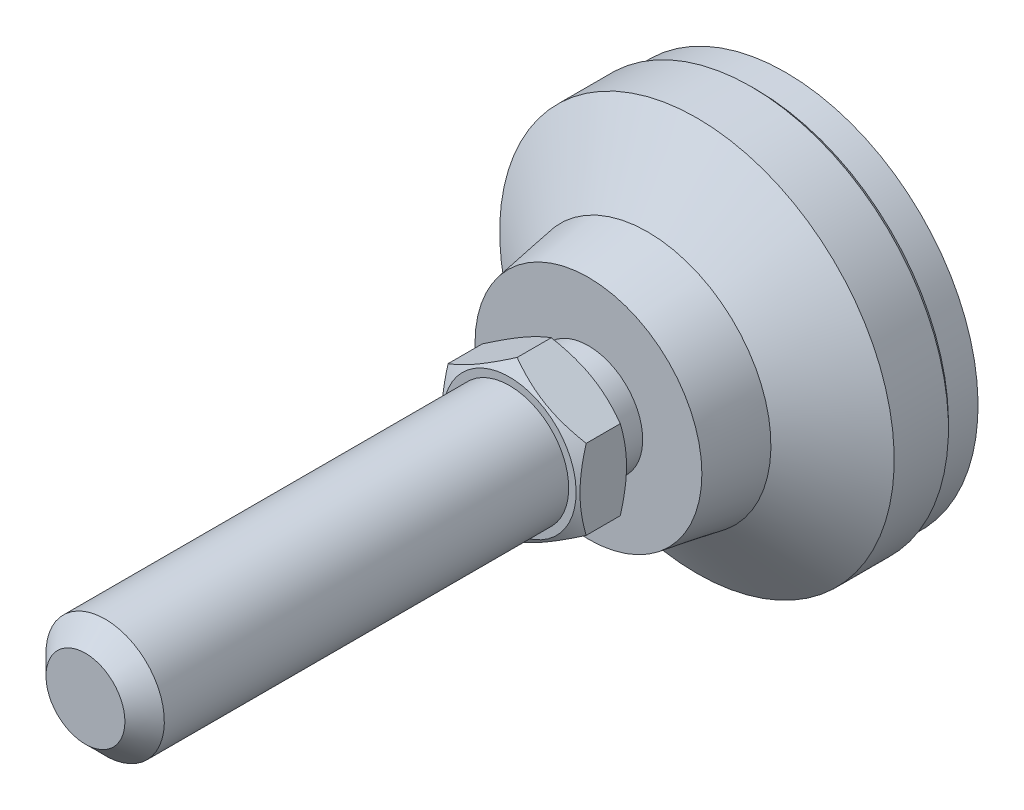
ISO-10303-21;
HEADER;
FILE_DESCRIPTION(('STEP AP214'),'2;1');
FILE_NAME('part.step','',(''),(''),'','','');
FILE_SCHEMA(('AUTOMOTIVE_DESIGN { 1 0 10303 214 1 1 1 1 }'));
ENDSEC;
DATA;
#1=APPLICATION_CONTEXT('core data for automotive mechanical design processes');
#2=APPLICATION_PROTOCOL_DEFINITION('international standard','automotive_design',2000,#1);
#3=PRODUCT_CONTEXT('',#1,'mechanical');
#4=PRODUCT('Part','Part','',(#3));
#5=PRODUCT_RELATED_PRODUCT_CATEGORY('part','',(#4));
#6=PRODUCT_DEFINITION_FORMATION('','',#4);
#7=PRODUCT_DEFINITION_CONTEXT('part definition',#1,'design');
#8=PRODUCT_DEFINITION('design','',#6,#7);
#9=PRODUCT_DEFINITION_SHAPE('','',#8);
#10=(LENGTH_UNIT() NAMED_UNIT(*) SI_UNIT(.MILLI.,.METRE.));
#11=(NAMED_UNIT(*) PLANE_ANGLE_UNIT() SI_UNIT($,.RADIAN.));
#12=(NAMED_UNIT(*) SI_UNIT($,.STERADIAN.) SOLID_ANGLE_UNIT());
#13=UNCERTAINTY_MEASURE_WITH_UNIT(LENGTH_MEASURE(1.E-05),#10,'distance_accuracy_value','');
#14=(GEOMETRIC_REPRESENTATION_CONTEXT(3) GLOBAL_UNCERTAINTY_ASSIGNED_CONTEXT((#13)) GLOBAL_UNIT_ASSIGNED_CONTEXT((#10,
#11,#12)) REPRESENTATION_CONTEXT('',''));
#15=CARTESIAN_POINT('',(0.,0.,0.));
#16=DIRECTION('',(0.,0.,1.));
#17=DIRECTION('',(1.,0.,0.));
#18=AXIS2_PLACEMENT_3D('',#15,#16,#17);
#19=CARTESIAN_POINT('',(0.,0.,1.99999999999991));
#20=DIRECTION('',(0.,0.,-1.));
#21=DIRECTION('',(0.,1.,0.));
#22=AXIS2_PLACEMENT_3D('',#19,#20,#21);
#23=CYLINDRICAL_SURFACE('',#22,20.);
#24=CARTESIAN_POINT('',(0.,0.,3.5));
#25=DIRECTION('',(0.,0.,-1.));
#26=DIRECTION('',(0.,1.,0.));
#27=AXIS2_PLACEMENT_3D('',#24,#25,#26);
#28=CIRCLE('',#27,20.);
#29=CARTESIAN_POINT('',(0.,20.,3.5));
#30=VERTEX_POINT('',#29);
#31=EDGE_CURVE('E114',#30,#30,#28,.F.);
#32=ORIENTED_EDGE('',*,*,#31,.T.);
#33=EDGE_LOOP('',(#32));
#34=FACE_BOUND('',#33,.T.);
#35=CARTESIAN_POINT('',(0.,0.,9.));
#36=DIRECTION('',(0.,0.,-1.));
#37=DIRECTION('',(0.,1.,0.));
#38=AXIS2_PLACEMENT_3D('',#35,#36,#37);
#39=CIRCLE('',#38,20.);
#40=CARTESIAN_POINT('',(0.,20.,9.));
#41=VERTEX_POINT('',#40);
#42=EDGE_CURVE('E108',#41,#41,#39,.T.);
#43=ORIENTED_EDGE('',*,*,#42,.T.);
#44=EDGE_LOOP('',(#43));
#45=FACE_BOUND('',#44,.T.);
#46=ADVANCED_FACE('F14',(#34,#45),#23,.T.);
#47=CARTESIAN_POINT('',(0.,0.,14.));
#48=DIRECTION('',(0.,0.,-1.));
#49=DIRECTION('',(0.,1.,0.));
#50=AXIS2_PLACEMENT_3D('',#47,#48,#49);
#51=CONICAL_SURFACE('',#50,12.5,0.98279372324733);
#52=ORIENTED_EDGE('',*,*,#42,.F.);
#53=EDGE_LOOP('',(#52));
#54=FACE_BOUND('',#53,.T.);
#55=CARTESIAN_POINT('',(0.,0.,14.));
#56=DIRECTION('',(0.,0.,-1.));
#57=DIRECTION('',(0.,1.,0.));
#58=AXIS2_PLACEMENT_3D('',#55,#56,#57);
#59=CIRCLE('',#58,12.5);
#60=CARTESIAN_POINT('',(0.,12.5,14.));
#61=VERTEX_POINT('',#60);
#62=EDGE_CURVE('E105',#61,#61,#59,.T.);
#63=ORIENTED_EDGE('',*,*,#62,.T.);
#64=EDGE_LOOP('',(#63));
#65=FACE_BOUND('',#64,.T.);
#66=ADVANCED_FACE('F226',(#54,#65),#51,.T.);
#67=CARTESIAN_POINT('',(0.,0.,20.));
#68=DIRECTION('',(0.,0.,-1.));
#69=DIRECTION('',(0.,1.,0.));
#70=AXIS2_PLACEMENT_3D('',#67,#68,#69);
#71=CONICAL_SURFACE('',#70,11.5,0.165148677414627);
#72=ORIENTED_EDGE('',*,*,#62,.F.);
#73=EDGE_LOOP('',(#72));
#74=FACE_BOUND('',#73,.T.);
#75=CARTESIAN_POINT('',(0.,0.,20.));
#76=DIRECTION('',(0.,0.,-1.));
#77=DIRECTION('',(0.,1.,0.));
#78=AXIS2_PLACEMENT_3D('',#75,#76,#77);
#79=CIRCLE('',#78,11.5);
#80=CARTESIAN_POINT('',(0.,11.5,20.));
#81=VERTEX_POINT('',#80);
#82=EDGE_CURVE('E102',#81,#81,#79,.T.);
#83=ORIENTED_EDGE('',*,*,#82,.T.);
#84=EDGE_LOOP('',(#83));
#85=FACE_BOUND('',#84,.T.);
#86=ADVANCED_FACE('F222',(#74,#85),#71,.T.);
#87=CARTESIAN_POINT('',(-11.5,0.,20.));
#88=DIRECTION('',(0.,0.,-1.));
#89=DIRECTION('',(0.,1.,0.));
#90=AXIS2_PLACEMENT_3D('',#87,#88,#89);
#91=PLANE('',#90);
#92=ORIENTED_EDGE('',*,*,#82,.F.);
#93=EDGE_LOOP('',(#92));
#94=FACE_BOUND('',#93,.T.);
#95=CARTESIAN_POINT('',(0.,0.,20.));
#96=DIRECTION('',(0.,0.,-1.));
#97=DIRECTION('',(0.,1.,0.));
#98=AXIS2_PLACEMENT_3D('',#95,#96,#97);
#99=CIRCLE('',#98,5.49999999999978);
#100=CARTESIAN_POINT('',(0.,5.49999999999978,20.));
#101=VERTEX_POINT('',#100);
#102=EDGE_CURVE('E99',#101,#101,#99,.T.);
#103=ORIENTED_EDGE('',*,*,#102,.T.);
#104=EDGE_LOOP('',(#103));
#105=FACE_BOUND('',#104,.T.);
#106=ADVANCED_FACE('F218',(#94,#105),#91,.F.);
#107=CARTESIAN_POINT('',(0.,0.,1.99999999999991));
#108=DIRECTION('',(0.,0.,-1.));
#109=DIRECTION('',(0.,1.,0.));
#110=AXIS2_PLACEMENT_3D('',#107,#108,#109);
#111=CYLINDRICAL_SURFACE('',#110,5.49999999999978);
#112=ORIENTED_EDGE('',*,*,#102,.F.);
#113=EDGE_LOOP('',(#112));
#114=FACE_BOUND('',#113,.T.);
#115=CARTESIAN_POINT('',(0.,0.,23.));
#116=DIRECTION('',(0.,0.,-1.));
#117=DIRECTION('',(0.,1.,0.));
#118=AXIS2_PLACEMENT_3D('',#115,#116,#117);
#119=CIRCLE('',#118,5.49999999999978);
#120=CARTESIAN_POINT('',(0.,5.49999999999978,23.));
#121=VERTEX_POINT('',#120);
#122=EDGE_CURVE('E96',#121,#121,#119,.T.);
#123=ORIENTED_EDGE('',*,*,#122,.T.);
#124=EDGE_LOOP('',(#123));
#125=FACE_BOUND('',#124,.T.);
#126=ADVANCED_FACE('F214',(#114,#125),#111,.T.);
#127=CARTESIAN_POINT('',(-5.49999999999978,0.,23.));
#128=DIRECTION('',(0.,0.,1.));
#129=DIRECTION('',(0.,-1.,0.));
#130=AXIS2_PLACEMENT_3D('',#127,#128,#129);
#131=PLANE('',#130);
#132=CARTESIAN_POINT('',(0.,0.,23.));
#133=DIRECTION('',(0.,0.,1.));
#134=DIRECTION('',(0.,-1.,0.));
#135=AXIS2_PLACEMENT_3D('',#132,#133,#134);
#136=CIRCLE('',#135,6.75);
#137=CARTESIAN_POINT('',(0.,-6.75,23.));
#138=VERTEX_POINT('',#137);
#139=EDGE_CURVE('E306',#138,#138,#136,.T.);
#140=ORIENTED_EDGE('',*,*,#139,.F.);
#141=EDGE_LOOP('',(#140));
#142=FACE_BOUND('',#141,.T.);
#143=ORIENTED_EDGE('',*,*,#122,.F.);
#144=EDGE_LOOP('',(#143));
#145=FACE_BOUND('',#144,.T.);
#146=ADVANCED_FACE('F211',(#142,#145),#131,.F.);
#147=CARTESIAN_POINT('',(0.,0.,3.));
#148=DIRECTION('',(0.,0.,1.));
#149=DIRECTION('',(0.,-1.,0.));
#150=AXIS2_PLACEMENT_3D('',#147,#148,#149);
#151=CONICAL_SURFACE('',#150,19.5,0.785398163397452);
#152=ORIENTED_EDGE('',*,*,#31,.F.);
#153=EDGE_LOOP('',(#152));
#154=FACE_BOUND('',#153,.T.);
#155=CARTESIAN_POINT('',(0.,0.,3.));
#156=DIRECTION('',(0.,0.,-1.));
#157=DIRECTION('',(0.,1.,0.));
#158=AXIS2_PLACEMENT_3D('',#155,#156,#157);
#159=CIRCLE('',#158,19.5);
#160=CARTESIAN_POINT('',(0.,19.5,3.));
#161=VERTEX_POINT('',#160);
#162=EDGE_CURVE('E111',#161,#161,#159,.T.);
#163=ORIENTED_EDGE('',*,*,#162,.F.);
#164=EDGE_LOOP('',(#163));
#165=FACE_BOUND('',#164,.T.);
#166=ADVANCED_FACE('F16',(#154,#165),#151,.T.);
#167=CARTESIAN_POINT('',(0.,0.,0.));
#168=DIRECTION('',(0.,0.,1.));
#169=DIRECTION('',(0.,-1.,0.));
#170=AXIS2_PLACEMENT_3D('',#167,#168,#169);
#171=CYLINDRICAL_SURFACE('',#170,19.5);
#172=CARTESIAN_POINT('',(0.,0.,0.));
#173=DIRECTION('',(0.,0.,-1.));
#174=DIRECTION('',(0.,1.,0.));
#175=AXIS2_PLACEMENT_3D('',#172,#173,#174);
#176=CIRCLE('',#175,19.5);
#177=CARTESIAN_POINT('',(0.,19.5,0.));
#178=VERTEX_POINT('',#177);
#179=EDGE_CURVE('E279',#178,#178,#176,.T.);
#180=ORIENTED_EDGE('',*,*,#179,.F.);
#181=EDGE_LOOP('',(#180));
#182=FACE_BOUND('',#181,.T.);
#183=ORIENTED_EDGE('',*,*,#162,.T.);
#184=EDGE_LOOP('',(#183));
#185=FACE_BOUND('',#184,.T.);
#186=ADVANCED_FACE('F251',(#182,#185),#171,.T.);
#187=CARTESIAN_POINT('',(0.,0.,0.));
#188=DIRECTION('',(0.,0.,-1.));
#189=DIRECTION('',(0.,1.,0.));
#190=AXIS2_PLACEMENT_3D('',#187,#188,#189);
#191=PLANE('',#190);
#192=ORIENTED_EDGE('',*,*,#179,.T.);
#193=EDGE_LOOP('',(#192));
#194=FACE_BOUND('',#193,.T.);
#195=ADVANCED_FACE('F134',(#194),#191,.T.);
#196=CARTESIAN_POINT('',(0.,0.,23.));
#197=DIRECTION('',(0.,0.,1.));
#198=DIRECTION('',(0.,-1.,0.));
#199=AXIS2_PLACEMENT_3D('',#196,#197,#198);
#200=CONICAL_SURFACE('',#199,6.75,1.0471975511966);
#201=CARTESIAN_POINT('',(0.000200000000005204,-8.08301923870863,23.7696190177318));
#202=CARTESIAN_POINT('',(-0.153667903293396,-7.99418356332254,23.7183374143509));
#203=CARTESIAN_POINT('',(-0.308109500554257,-7.90501666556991,23.669383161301));
#204=CARTESIAN_POINT('',(-0.618246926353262,-7.72595873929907,23.5767703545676));
#205=CARTESIAN_POINT('',(-0.773943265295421,-7.63606741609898,23.5331140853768));
#206=CARTESIAN_POINT('',(-1.24352516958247,-7.36495417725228,23.4109491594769));
#207=CARTESIAN_POINT('',(-1.55926433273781,-7.18266208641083,23.3414631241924));
#208=CARTESIAN_POINT('',(-2.03176224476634,-6.90986528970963,23.2599825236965));
#209=CARTESIAN_POINT('',(-2.18710922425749,-6.82017566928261,23.2367710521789));
#210=CARTESIAN_POINT('',(-2.49850511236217,-6.64039116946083,23.1978487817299));
#211=CARTESIAN_POINT('',(-2.65455395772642,-6.55029632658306,23.1821373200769));
#212=CARTESIAN_POINT('',(-2.96692267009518,-6.36995016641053,23.1586154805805));
#213=CARTESIAN_POINT('',(-3.12324202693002,-6.27969914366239,23.1507961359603));
#214=CARTESIAN_POINT('',(-3.43601650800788,-6.09911871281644,23.1432178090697));
#215=CARTESIAN_POINT('',(-3.59247162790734,-6.00878930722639,23.1434585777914));
#216=CARTESIAN_POINT('',(-4.02110687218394,-5.76131663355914,23.1551972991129));
#217=CARTESIAN_POINT('',(-4.2931466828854,-5.60425437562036,23.1749033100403));
#218=CARTESIAN_POINT('',(-4.83541944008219,-5.29117305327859,23.2373910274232));
#219=CARTESIAN_POINT('',(-5.10565047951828,-5.13515508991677,23.2801940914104));
#220=CARTESIAN_POINT('',(-5.64901454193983,-4.82144370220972,23.3871892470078));
#221=CARTESIAN_POINT('',(-5.92207900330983,-4.66378986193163,23.4518346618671));
#222=CARTESIAN_POINT('',(-6.46413578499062,-4.35083323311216,23.5985536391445));
#223=CARTESIAN_POINT('',(-6.73313504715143,-4.19552643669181,23.680592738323));
#224=CARTESIAN_POINT('',(-7.0002,-4.04133641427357,23.7696190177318));
#225=B_SPLINE_CURVE_WITH_KNOTS('',3,(#201,#202,#203,#204,#205,#206,#207,#208,#209,#210,#211,
#212,#213,#214,#215,#216,#217,#218,#219,#220,#221,#222,#223,#224),.UNSPECIFIED.,.F.,.F.,(4,2,2,
2,2,2,2,2,2,2,2,4),(0.,0.554727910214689,1.10969417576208,2.22193274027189,2.76443041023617,
3.30688013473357,3.84871284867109,4.39052882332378,5.33376515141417,6.27787517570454,
7.24292418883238,8.20607866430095),.UNSPECIFIED.);
#226=CARTESIAN_POINT('',(0.,-8.08290376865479,23.7695523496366));
#227=VERTEX_POINT('',#226);
#228=CARTESIAN_POINT('',(-7.,-4.04145188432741,23.7695523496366));
#229=VERTEX_POINT('',#228);
#230=EDGE_CURVE('E73',#227,#229,#225,.T.);
#231=ORIENTED_EDGE('',*,*,#230,.T.);
#232=CARTESIAN_POINT('',(-7.,10.8151841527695,26.5408112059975));
#233=CARTESIAN_POINT('',(-7.,10.509785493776,26.3928294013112));
#234=CARTESIAN_POINT('',(-7.,10.2036813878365,26.2462783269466));
#235=CARTESIAN_POINT('',(-7.,9.58968695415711,25.9568431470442));
#236=CARTESIAN_POINT('',(-7.,9.281796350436,25.8139596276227));
#237=CARTESIAN_POINT('',(-7.,8.66224766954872,25.531937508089));
#238=CARTESIAN_POINT('',(-7.,8.35057818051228,25.3928238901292));
#239=CARTESIAN_POINT('',(-7.,7.72474604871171,25.1203442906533));
#240=CARTESIAN_POINT('',(-7.,7.41058352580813,24.9869780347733));
#241=CARTESIAN_POINT('',(-7.,6.76928533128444,24.7234102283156));
#242=CARTESIAN_POINT('',(-7.,6.44205334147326,24.5934417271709));
#243=CARTESIAN_POINT('',(-7.,5.7837467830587,24.3434399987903));
#244=CARTESIAN_POINT('',(-7.,5.45267178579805,24.2234078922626));
#245=CARTESIAN_POINT('',(-7.,4.78678140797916,23.9964602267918));
#246=CARTESIAN_POINT('',(-7.,4.45197529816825,23.8895177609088));
#247=CARTESIAN_POINT('',(-7.,3.77757296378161,23.6922062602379));
#248=CARTESIAN_POINT('',(-7.,3.43797829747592,23.6018319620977));
#249=CARTESIAN_POINT('',(-7.,2.7556250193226,23.4425048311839));
#250=CARTESIAN_POINT('',(-7.,2.41289389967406,23.3734374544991));
#251=CARTESIAN_POINT('',(-7.,1.89570899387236,23.2888272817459));
#252=CARTESIAN_POINT('',(-7.,1.72278631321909,23.2637878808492));
#253=CARTESIAN_POINT('',(-7.,1.3760953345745,23.2205314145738));
#254=CARTESIAN_POINT('',(-7.,1.20232711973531,23.2023136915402));
#255=CARTESIAN_POINT('',(-7.,0.856430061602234,23.1732899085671));
#256=CARTESIAN_POINT('',(-7.,0.684309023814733,23.1623911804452));
#257=CARTESIAN_POINT('',(-7.,0.339760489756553,23.1478793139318));
#258=CARTESIAN_POINT('',(-7.,0.167332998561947,23.1442660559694));
#259=CARTESIAN_POINT('',(-7.,-0.17752071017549,23.1444112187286));
#260=CARTESIAN_POINT('',(-7.,-0.349946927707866,23.148169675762));
#261=CARTESIAN_POINT('',(-7.,-0.69448892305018,23.1629671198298));
#262=CARTESIAN_POINT('',(-7.,-0.866604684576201,23.1740064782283));
#263=CARTESIAN_POINT('',(-7.,-1.28149093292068,23.2091602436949));
#264=CARTESIAN_POINT('',(-7.,-1.52396904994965,23.2367979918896));
#265=CARTESIAN_POINT('',(-7.,-2.00708738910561,23.305006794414));
#266=CARTESIAN_POINT('',(-7.,-2.24772735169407,23.3455796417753));
#267=CARTESIAN_POINT('',(-7.,-2.96663631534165,23.4845461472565));
#268=CARTESIAN_POINT('',(-7.,-3.44161827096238,23.6001613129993));
#269=CARTESIAN_POINT('',(-7.,-4.15179107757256,23.800167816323));
#270=CARTESIAN_POINT('',(-7.,-4.39067758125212,23.8721874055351));
#271=CARTESIAN_POINT('',(-7.,-4.86612952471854,24.0235870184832));
#272=CARTESIAN_POINT('',(-7.,-5.10269494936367,24.1029670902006));
#273=CARTESIAN_POINT('',(-7.,-5.57358148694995,24.267824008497));
#274=CARTESIAN_POINT('',(-7.,-5.80790333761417,24.3532987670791));
#275=CARTESIAN_POINT('',(-7.,-6.27461368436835,24.5293513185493));
#276=CARTESIAN_POINT('',(-7.,-6.50700220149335,24.6199290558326));
#277=CARTESIAN_POINT('',(-7.,-7.04881704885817,24.8368716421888));
#278=CARTESIAN_POINT('',(-7.,-7.3575637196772,24.9649306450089));
#279=CARTESIAN_POINT('',(-7.,-7.97248897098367,25.2270900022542));
#280=CARTESIAN_POINT('',(-7.,-8.27866740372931,25.3611907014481));
#281=CARTESIAN_POINT('',(-7.,-8.88891991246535,25.6342386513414));
#282=CARTESIAN_POINT('',(-7.,-9.19299357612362,25.7731868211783));
#283=CARTESIAN_POINT('',(-7.,-9.79933545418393,26.054974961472));
#284=CARTESIAN_POINT('',(-7.,-10.1016036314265,26.197815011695));
#285=CARTESIAN_POINT('',(-7.,-10.7049285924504,26.4868120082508));
#286=CARTESIAN_POINT('',(-7.,-11.0059838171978,26.6329722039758));
#287=CARTESIAN_POINT('',(-7.,-11.6068097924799,26.9279116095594));
#288=CARTESIAN_POINT('',(-7.,-11.90658053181,27.0766908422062));
#289=CARTESIAN_POINT('',(-7.,-12.8041931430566,27.5262323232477));
#290=CARTESIAN_POINT('',(-7.,-13.4004118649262,27.8302352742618));
#291=CARTESIAN_POINT('',(-7.,-14.5409123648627,28.4191596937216));
#292=CARTESIAN_POINT('',(-7.,-15.0854431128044,28.7036011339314));
#293=CARTESIAN_POINT('',(-7.,-16.1724761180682,29.2763749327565));
#294=CARTESIAN_POINT('',(-7.,-16.7149783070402,29.5647074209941));
#295=CARTESIAN_POINT('',(-7.,-17.7970953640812,30.1436469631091));
#296=CARTESIAN_POINT('',(-7.,-18.3367140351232,30.4342469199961));
#297=CARTESIAN_POINT('',(-7.,-19.4146505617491,31.0177824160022));
#298=CARTESIAN_POINT('',(-7.,-19.9529684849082,31.3107178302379));
#299=CARTESIAN_POINT('',(-7.,-20.4908057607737,31.6045271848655));
#300=B_SPLINE_CURVE_WITH_KNOTS('',3,(#232,#233,#234,#235,#236,#237,#238,#239,#240,#241,#242,
#243,#244,#245,#246,#247,#248,#249,#250,#251,#252,#253,#254,#255,#256,#257,#258,#259,#260,#261,
#262,#263,#264,#265,#266,#267,#268,#269,#270,#271,#272,#273,#274,#275,#276,#277,#278,#279,#280,
#281,#282,#283,#284,#285,#286,#287,#288,#289,#290,#291,#292,#293,#294,#295,#296,#297,#298,#299),
.UNSPECIFIED.,.F.,.F.,(4,2,2,2,2,2,2,2,2,2,2,2,2,2,2,2,2,2,2,2,2,2,2,2,2,2,2,2,2,2,2,2,2,4),(0.,
1.01810034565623,2.03636239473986,3.06023692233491,4.08406251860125,5.1402295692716,
6.19651558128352,7.25059247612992,8.3043339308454,9.35230767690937,9.87637270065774,
10.4003871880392,10.9176351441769,11.4348746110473,11.9521166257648,12.4693850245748,
13.2011150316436,13.9329465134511,15.3974379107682,16.1458970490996,16.8943610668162,
17.6425698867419,18.390770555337,19.3934370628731,20.3961608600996,21.3990758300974,
22.402011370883,23.405974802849,24.4099469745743,26.4176366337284,28.2606569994,
30.1037389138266,31.9424089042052,33.7809812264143),.UNSPECIFIED.);
#301=CARTESIAN_POINT('',(-7.,4.04145188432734,23.7695523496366));
#302=VERTEX_POINT('',#301);
#303=EDGE_CURVE('E81',#229,#302,#300,.F.);
#304=ORIENTED_EDGE('',*,*,#303,.T.);
#305=CARTESIAN_POINT('',(-7.0002,4.0413364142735,23.7696190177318));
#306=CARTESIAN_POINT('',(-6.8463320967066,4.13017208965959,23.7183374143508));
#307=CARTESIAN_POINT('',(-6.69189049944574,4.21933898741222,23.669383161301));
#308=CARTESIAN_POINT('',(-6.38175307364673,4.39839691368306,23.5767703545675));
#309=CARTESIAN_POINT('',(-6.22605673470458,4.48828823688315,23.5331140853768));
#310=CARTESIAN_POINT('',(-5.75647483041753,4.75940147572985,23.4109491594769));
#311=CARTESIAN_POINT('',(-5.4407356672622,4.94169356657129,23.3414631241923));
#312=CARTESIAN_POINT('',(-4.96823775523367,5.2144903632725,23.2599825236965));
#313=CARTESIAN_POINT('',(-4.81289077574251,5.30417998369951,23.2367710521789));
#314=CARTESIAN_POINT('',(-4.50149488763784,5.48396448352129,23.1978487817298));
#315=CARTESIAN_POINT('',(-4.34544604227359,5.57405932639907,23.1821373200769));
#316=CARTESIAN_POINT('',(-4.03307732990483,5.75440548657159,23.1586154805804));
#317=CARTESIAN_POINT('',(-3.87675797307,5.84465650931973,23.1507961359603));
#318=CARTESIAN_POINT('',(-3.56398349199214,6.02523694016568,23.1432178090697));
#319=CARTESIAN_POINT('',(-3.40752837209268,6.11556634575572,23.1434585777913));
#320=CARTESIAN_POINT('',(-2.97889312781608,6.36303901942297,23.1551972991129));
#321=CARTESIAN_POINT('',(-2.70685331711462,6.52010127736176,23.1749033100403));
#322=CARTESIAN_POINT('',(-2.16458055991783,6.83318259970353,23.2373910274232));
#323=CARTESIAN_POINT('',(-1.89434952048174,6.98920056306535,23.2801940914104));
#324=CARTESIAN_POINT('',(-1.35098545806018,7.3029119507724,23.3871892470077));
#325=CARTESIAN_POINT('',(-1.07792099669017,7.4605657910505,23.4518346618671));
#326=CARTESIAN_POINT('',(-0.535864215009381,7.77352241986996,23.5985536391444));
#327=CARTESIAN_POINT('',(-0.266864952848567,7.92882921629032,23.6805927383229));
#328=CARTESIAN_POINT('',(0.000200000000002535,8.08301923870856,23.7696190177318));
#329=B_SPLINE_CURVE_WITH_KNOTS('',3,(#305,#306,#307,#308,#309,#310,#311,#312,#313,#314,#315,
#316,#317,#318,#319,#320,#321,#322,#323,#324,#325,#326,#327,#328),.UNSPECIFIED.,.F.,.F.,(4,2,2,
2,2,2,2,2,2,2,2,4),(0.,0.554727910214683,1.10969417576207,2.22193274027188,2.76443041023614,
3.30688013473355,3.84871284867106,4.39052882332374,5.33376515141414,6.27787517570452,
7.24292418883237,8.20607866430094),.UNSPECIFIED.);
#330=CARTESIAN_POINT('',(0.,8.08290376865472,23.7695523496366));
#331=VERTEX_POINT('',#330);
#332=EDGE_CURVE('E193',#302,#331,#329,.T.);
#333=ORIENTED_EDGE('',*,*,#332,.T.);
#334=CARTESIAN_POINT('',(-0.000199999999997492,8.08301923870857,23.7696190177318));
#335=CARTESIAN_POINT('',(0.153667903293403,7.99418356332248,23.7183374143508));
#336=CARTESIAN_POINT('',(0.308109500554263,7.90501666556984,23.669383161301));
#337=CARTESIAN_POINT('',(0.618246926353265,7.72595873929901,23.5767703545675));
#338=CARTESIAN_POINT('',(0.773943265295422,7.63606741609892,23.5331140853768));
#339=CARTESIAN_POINT('',(1.24352516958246,7.36495417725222,23.4109491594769));
#340=CARTESIAN_POINT('',(1.5592643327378,7.18266208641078,23.3414631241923));
#341=CARTESIAN_POINT('',(2.03176224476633,6.90986528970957,23.2599825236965));
#342=CARTESIAN_POINT('',(2.18710922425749,6.82017566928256,23.2367710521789));
#343=CARTESIAN_POINT('',(2.49850511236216,6.64039116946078,23.1978487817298));
#344=CARTESIAN_POINT('',(2.65455395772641,6.550296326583,23.1821373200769));
#345=CARTESIAN_POINT('',(2.96692267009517,6.36995016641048,23.1586154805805));
#346=CARTESIAN_POINT('',(3.12324202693,6.27969914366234,23.1507961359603));
#347=CARTESIAN_POINT('',(3.43601650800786,6.09911871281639,23.1432178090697));
#348=CARTESIAN_POINT('',(3.59247162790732,6.00878930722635,23.1434585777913));
#349=CARTESIAN_POINT('',(4.02110687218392,5.7613166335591,23.1551972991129));
#350=CARTESIAN_POINT('',(4.29314668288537,5.60425437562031,23.1749033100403));
#351=CARTESIAN_POINT('',(4.83541944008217,5.29117305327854,23.2373910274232));
#352=CARTESIAN_POINT('',(5.10565047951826,5.13515508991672,23.2801940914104));
#353=CARTESIAN_POINT('',(5.64901454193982,4.82144370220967,23.3871892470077));
#354=CARTESIAN_POINT('',(5.92207900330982,4.66378986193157,23.4518346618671));
#355=CARTESIAN_POINT('',(6.46413578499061,4.35083323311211,23.5985536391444));
#356=CARTESIAN_POINT('',(6.73313504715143,4.19552643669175,23.6805927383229));
#357=CARTESIAN_POINT('',(7.0002,4.04133641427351,23.7696190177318));
#358=B_SPLINE_CURVE_WITH_KNOTS('',3,(#334,#335,#336,#337,#338,#339,#340,#341,#342,#343,#344,
#345,#346,#347,#348,#349,#350,#351,#352,#353,#354,#355,#356,#357),.UNSPECIFIED.,.F.,.F.,(4,2,2,
2,2,2,2,2,2,2,2,4),(0.,0.554727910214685,1.10969417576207,2.22193274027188,2.76443041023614,
3.30688013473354,3.84871284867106,4.39052882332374,5.33376515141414,6.27787517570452,
7.24292418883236,8.20607866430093),.UNSPECIFIED.);
#359=CARTESIAN_POINT('',(7.,4.04145188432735,23.7695523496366));
#360=VERTEX_POINT('',#359);
#361=EDGE_CURVE('E305',#331,#360,#358,.T.);
#362=ORIENTED_EDGE('',*,*,#361,.T.);
#363=CARTESIAN_POINT('',(7.,10.8151841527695,26.5408112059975));
#364=CARTESIAN_POINT('',(7.,10.509785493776,26.3928294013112));
#365=CARTESIAN_POINT('',(7.,10.2036813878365,26.2462783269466));
#366=CARTESIAN_POINT('',(7.,9.58968695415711,25.9568431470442));
#367=CARTESIAN_POINT('',(7.,9.281796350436,25.8139596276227));
#368=CARTESIAN_POINT('',(7.,8.66224766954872,25.531937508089));
#369=CARTESIAN_POINT('',(7.,8.35057818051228,25.3928238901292));
#370=CARTESIAN_POINT('',(7.,7.72474604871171,25.1203442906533));
#371=CARTESIAN_POINT('',(7.,7.41058352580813,24.9869780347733));
#372=CARTESIAN_POINT('',(7.,6.76928533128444,24.7234102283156));
#373=CARTESIAN_POINT('',(7.,6.44205334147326,24.5934417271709));
#374=CARTESIAN_POINT('',(7.,5.7837467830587,24.3434399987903));
#375=CARTESIAN_POINT('',(7.,5.45267178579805,24.2234078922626));
#376=CARTESIAN_POINT('',(7.,4.78678140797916,23.9964602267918));
#377=CARTESIAN_POINT('',(7.,4.45197529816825,23.8895177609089));
#378=CARTESIAN_POINT('',(7.,3.77757296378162,23.6922062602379));
#379=CARTESIAN_POINT('',(7.,3.43797829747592,23.6018319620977));
#380=CARTESIAN_POINT('',(7.,2.7556250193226,23.4425048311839));
#381=CARTESIAN_POINT('',(7.,2.41289389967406,23.3734374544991));
#382=CARTESIAN_POINT('',(7.,1.89570899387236,23.2888272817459));
#383=CARTESIAN_POINT('',(7.,1.7227863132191,23.2637878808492));
#384=CARTESIAN_POINT('',(7.,1.3760953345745,23.2205314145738));
#385=CARTESIAN_POINT('',(7.,1.20232711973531,23.2023136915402));
#386=CARTESIAN_POINT('',(7.,0.85643006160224,23.1732899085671));
#387=CARTESIAN_POINT('',(7.,0.68430902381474,23.1623911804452));
#388=CARTESIAN_POINT('',(7.,0.339760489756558,23.1478793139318));
#389=CARTESIAN_POINT('',(7.,0.167332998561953,23.1442660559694));
#390=CARTESIAN_POINT('',(7.,-0.177520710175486,23.1444112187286));
#391=CARTESIAN_POINT('',(7.,-0.349946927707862,23.148169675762));
#392=CARTESIAN_POINT('',(7.,-0.694488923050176,23.1629671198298));
#393=CARTESIAN_POINT('',(7.,-0.866604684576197,23.1740064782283));
#394=CARTESIAN_POINT('',(7.,-1.28149093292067,23.2091602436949));
#395=CARTESIAN_POINT('',(7.,-1.52396904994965,23.2367979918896));
#396=CARTESIAN_POINT('',(7.,-2.00708738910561,23.305006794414));
#397=CARTESIAN_POINT('',(7.,-2.24772735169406,23.3455796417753));
#398=CARTESIAN_POINT('',(7.,-2.96663631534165,23.4845461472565));
#399=CARTESIAN_POINT('',(7.,-3.44161827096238,23.6001613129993));
#400=CARTESIAN_POINT('',(7.,-4.15179107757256,23.800167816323));
#401=CARTESIAN_POINT('',(7.,-4.39067758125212,23.8721874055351));
#402=CARTESIAN_POINT('',(7.,-4.86612952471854,24.0235870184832));
#403=CARTESIAN_POINT('',(7.,-5.10269494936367,24.1029670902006));
#404=CARTESIAN_POINT('',(7.,-5.57358148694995,24.267824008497));
#405=CARTESIAN_POINT('',(7.,-5.80790333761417,24.3532987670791));
#406=CARTESIAN_POINT('',(7.,-6.27461368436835,24.5293513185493));
#407=CARTESIAN_POINT('',(7.,-6.50700220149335,24.6199290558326));
#408=CARTESIAN_POINT('',(7.,-7.04881704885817,24.8368716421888));
#409=CARTESIAN_POINT('',(7.,-7.3575637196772,24.9649306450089));
#410=CARTESIAN_POINT('',(7.,-7.97248897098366,25.2270900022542));
#411=CARTESIAN_POINT('',(7.,-8.2786674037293,25.3611907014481));
#412=CARTESIAN_POINT('',(7.,-8.88891991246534,25.6342386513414));
#413=CARTESIAN_POINT('',(7.,-9.19299357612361,25.7731868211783));
#414=CARTESIAN_POINT('',(7.,-9.79933545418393,26.0549749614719));
#415=CARTESIAN_POINT('',(7.,-10.1016036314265,26.197815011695));
#416=CARTESIAN_POINT('',(7.,-10.7049285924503,26.4868120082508));
#417=CARTESIAN_POINT('',(7.,-11.0059838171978,26.6329722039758));
#418=CARTESIAN_POINT('',(7.,-11.6068097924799,26.9279116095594));
#419=CARTESIAN_POINT('',(7.,-11.9065805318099,27.0766908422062));
#420=CARTESIAN_POINT('',(7.,-12.8041931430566,27.5262323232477));
#421=CARTESIAN_POINT('',(7.,-13.4004118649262,27.8302352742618));
#422=CARTESIAN_POINT('',(7.,-14.5409123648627,28.4191596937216));
#423=CARTESIAN_POINT('',(7.,-15.0854431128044,28.7036011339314));
#424=CARTESIAN_POINT('',(7.,-16.1724761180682,29.2763749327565));
#425=CARTESIAN_POINT('',(7.,-16.7149783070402,29.5647074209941));
#426=CARTESIAN_POINT('',(7.,-17.7970953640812,30.1436469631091));
#427=CARTESIAN_POINT('',(7.,-18.3367140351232,30.4342469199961));
#428=CARTESIAN_POINT('',(7.,-19.4146505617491,31.0177824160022));
#429=CARTESIAN_POINT('',(7.,-19.9529684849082,31.3107178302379));
#430=CARTESIAN_POINT('',(7.,-20.4908057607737,31.6045271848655));
#431=B_SPLINE_CURVE_WITH_KNOTS('',3,(#363,#364,#365,#366,#367,#368,#369,#370,#371,#372,#373,
#374,#375,#376,#377,#378,#379,#380,#381,#382,#383,#384,#385,#386,#387,#388,#389,#390,#391,#392,
#393,#394,#395,#396,#397,#398,#399,#400,#401,#402,#403,#404,#405,#406,#407,#408,#409,#410,#411,
#412,#413,#414,#415,#416,#417,#418,#419,#420,#421,#422,#423,#424,#425,#426,#427,#428,#429,#430),
.UNSPECIFIED.,.F.,.F.,(4,2,2,2,2,2,2,2,2,2,2,2,2,2,2,2,2,2,2,2,2,2,2,2,2,2,2,2,2,2,2,2,2,4),(0.,
1.01810034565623,2.03636239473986,3.06023692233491,4.08406251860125,5.1402295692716,
6.19651558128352,7.25059247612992,8.3043339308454,9.35230767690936,9.87637270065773,
10.4003871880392,10.9176351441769,11.4348746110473,11.9521166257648,12.4693850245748,
13.2011150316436,13.9329465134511,15.3974379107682,16.1458970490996,16.8943610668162,
17.6425698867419,18.390770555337,19.3934370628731,20.3961608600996,21.3990758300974,
22.402011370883,23.405974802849,24.4099469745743,26.4176366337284,28.2606569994,
30.1037389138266,31.9424089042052,33.7809812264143),.UNSPECIFIED.);
#432=CARTESIAN_POINT('',(7.,-4.04145188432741,23.7695523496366));
#433=VERTEX_POINT('',#432);
#434=EDGE_CURVE('E34',#360,#433,#431,.T.);
#435=ORIENTED_EDGE('',*,*,#434,.T.);
#436=CARTESIAN_POINT('',(7.0002,-4.04133641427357,23.7696190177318));
#437=CARTESIAN_POINT('',(6.8463320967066,-4.13017208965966,23.7183374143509));
#438=CARTESIAN_POINT('',(6.69189049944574,-4.2193389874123,23.669383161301));
#439=CARTESIAN_POINT('',(6.38175307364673,-4.39839691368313,23.5767703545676));
#440=CARTESIAN_POINT('',(6.22605673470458,-4.48828823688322,23.5331140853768));
#441=CARTESIAN_POINT('',(5.75647483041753,-4.75940147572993,23.4109491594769));
#442=CARTESIAN_POINT('',(5.44073566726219,-4.94169356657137,23.3414631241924));
#443=CARTESIAN_POINT('',(4.96823775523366,-5.21449036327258,23.2599825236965));
#444=CARTESIAN_POINT('',(4.8128907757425,-5.30417998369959,23.2367710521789));
#445=CARTESIAN_POINT('',(4.50149488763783,-5.48396448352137,23.1978487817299));
#446=CARTESIAN_POINT('',(4.34544604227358,-5.57405932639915,23.1821373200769));
#447=CARTESIAN_POINT('',(4.03307732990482,-5.75440548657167,23.1586154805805));
#448=CARTESIAN_POINT('',(3.87675797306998,-5.84465650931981,23.1507961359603));
#449=CARTESIAN_POINT('',(3.56398349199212,-6.02523694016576,23.1432178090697));
#450=CARTESIAN_POINT('',(3.40752837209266,-6.11556634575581,23.1434585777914));
#451=CARTESIAN_POINT('',(2.97889312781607,-6.36303901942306,23.1551972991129));
#452=CARTESIAN_POINT('',(2.70685331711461,-6.52010127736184,23.1749033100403));
#453=CARTESIAN_POINT('',(2.16458055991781,-6.83318259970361,23.2373910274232));
#454=CARTESIAN_POINT('',(1.89434952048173,-6.98920056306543,23.2801940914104));
#455=CARTESIAN_POINT('',(1.35098545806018,-7.30291195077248,23.3871892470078));
#456=CARTESIAN_POINT('',(1.07792099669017,-7.46056579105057,23.4518346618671));
#457=CARTESIAN_POINT('',(0.535864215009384,-7.77352241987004,23.5985536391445));
#458=CARTESIAN_POINT('',(0.266864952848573,-7.92882921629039,23.680592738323));
#459=CARTESIAN_POINT('',(-0.000199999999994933,-8.08301923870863,23.7696190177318));
#460=B_SPLINE_CURVE_WITH_KNOTS('',3,(#436,#437,#438,#439,#440,#441,#442,#443,#444,#445,#446,
#447,#448,#449,#450,#451,#452,#453,#454,#455,#456,#457,#458,#459),.UNSPECIFIED.,.F.,.F.,(4,2,2,
2,2,2,2,2,2,2,2,4),(0.,0.554727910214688,1.10969417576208,2.22193274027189,2.76443041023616,
3.30688013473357,3.84871284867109,4.39052882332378,5.33376515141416,6.27787517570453,
7.24292418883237,8.20607866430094),.UNSPECIFIED.);
#461=EDGE_CURVE('E9',#433,#227,#460,.T.);
#462=ORIENTED_EDGE('',*,*,#461,.T.);
#463=EDGE_LOOP('',(#231,#304,#333,#362,#435,#462));
#464=FACE_BOUND('',#463,.T.);
#465=ORIENTED_EDGE('',*,*,#139,.T.);
#466=EDGE_LOOP('',(#465));
#467=FACE_BOUND('',#466,.T.);
#468=ADVANCED_FACE('F71',(#464,#467),#200,.T.);
#469=CARTESIAN_POINT('',(-5.,18.4902968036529,71.));
#470=DIRECTION('',(0.,0.,-1.));
#471=DIRECTION('',(0.,1.,0.));
#472=AXIS2_PLACEMENT_3D('',#469,#470,#471);
#473=PLANE('',#472);
#474=CARTESIAN_POINT('',(0.,0.,71.));
#475=DIRECTION('',(0.,0.,-1.));
#476=DIRECTION('',(0.,1.,0.));
#477=AXIS2_PLACEMENT_3D('',#474,#475,#476);
#478=CIRCLE('',#477,3.99999999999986);
#479=CARTESIAN_POINT('',(0.,3.99999999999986,71.));
#480=VERTEX_POINT('',#479);
#481=EDGE_CURVE('E92',#480,#480,#478,.T.);
#482=ORIENTED_EDGE('',*,*,#481,.F.);
#483=EDGE_LOOP('',(#482));
#484=FACE_BOUND('',#483,.T.);
#485=ADVANCED_FACE('F263',(#484),#473,.F.);
#486=CARTESIAN_POINT('',(0.,0.,71.));
#487=DIRECTION('',(0.,0.,-1.));
#488=DIRECTION('',(0.,1.,0.));
#489=AXIS2_PLACEMENT_3D('',#486,#487,#488);
#490=CONICAL_SURFACE('',#489,4.,0.785398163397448);
#491=CARTESIAN_POINT('',(0.,0.,69.));
#492=DIRECTION('',(0.,0.,-1.));
#493=DIRECTION('',(0.,1.,0.));
#494=AXIS2_PLACEMENT_3D('',#491,#492,#493);
#495=CIRCLE('',#494,6.);
#496=CARTESIAN_POINT('',(0.,6.,69.));
#497=VERTEX_POINT('',#496);
#498=EDGE_CURVE('E87',#497,#497,#495,.T.);
#499=ORIENTED_EDGE('',*,*,#498,.F.);
#500=EDGE_LOOP('',(#499));
#501=FACE_BOUND('',#500,.T.);
#502=ORIENTED_EDGE('',*,*,#481,.T.);
#503=EDGE_LOOP('',(#502));
#504=FACE_BOUND('',#503,.T.);
#505=ADVANCED_FACE('F183',(#501,#504),#490,.T.);
#506=CARTESIAN_POINT('',(0.,0.,-4.74975615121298));
#507=DIRECTION('',(0.,0.,-1.));
#508=DIRECTION('',(0.,1.,0.));
#509=AXIS2_PLACEMENT_3D('',#506,#507,#508);
#510=CYLINDRICAL_SURFACE('',#509,6.);
#511=CARTESIAN_POINT('',(0.,0.,28.));
#512=DIRECTION('',(0.,0.,-1.));
#513=DIRECTION('',(0.,1.,0.));
#514=AXIS2_PLACEMENT_3D('',#511,#512,#513);
#515=CIRCLE('',#514,6.);
#516=CARTESIAN_POINT('',(0.,6.,28.));
#517=VERTEX_POINT('',#516);
#518=EDGE_CURVE('E117',#517,#517,#515,.F.);
#519=ORIENTED_EDGE('',*,*,#518,.T.);
#520=EDGE_LOOP('',(#519));
#521=FACE_BOUND('',#520,.T.);
#522=ORIENTED_EDGE('',*,*,#498,.T.);
#523=EDGE_LOOP('',(#522));
#524=FACE_BOUND('',#523,.T.);
#525=ADVANCED_FACE('F209',(#521,#524),#510,.T.);
#526=CARTESIAN_POINT('',(-3.99999999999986,0.,28.));
#527=DIRECTION('',(0.,0.,-1.));
#528=DIRECTION('',(0.,1.,0.));
#529=AXIS2_PLACEMENT_3D('',#526,#527,#528);
#530=PLANE('',#529);
#531=CARTESIAN_POINT('',(0.,0.,28.));
#532=DIRECTION('',(0.,0.,1.));
#533=DIRECTION('',(0.,-1.,0.));
#534=AXIS2_PLACEMENT_3D('',#531,#532,#533);
#535=CIRCLE('',#534,6.75);
#536=CARTESIAN_POINT('',(0.,-6.75,28.));
#537=VERTEX_POINT('',#536);
#538=EDGE_CURVE('E80',#537,#537,#535,.T.);
#539=ORIENTED_EDGE('',*,*,#538,.T.);
#540=EDGE_LOOP('',(#539));
#541=FACE_BOUND('',#540,.T.);
#542=ORIENTED_EDGE('',*,*,#518,.F.);
#543=EDGE_LOOP('',(#542));
#544=FACE_BOUND('',#543,.T.);
#545=ADVANCED_FACE('F131',(#541,#544),#530,.F.);
#546=CARTESIAN_POINT('',(0.,0.,26.3913993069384));
#547=DIRECTION('',(0.,0.,-1.));
#548=DIRECTION('',(0.,1.,0.));
#549=AXIS2_PLACEMENT_3D('',#546,#547,#548);
#550=CONICAL_SURFACE('',#549,9.53617812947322,1.0471975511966);
#551=CARTESIAN_POINT('',(-7.0002,-4.04133641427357,27.230380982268));
#552=CARTESIAN_POINT('',(-6.84633209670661,-4.13017208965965,27.281662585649));
#553=CARTESIAN_POINT('',(-6.69189049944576,-4.21933898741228,27.3306168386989));
#554=CARTESIAN_POINT('',(-6.38175307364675,-4.39839691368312,27.4232296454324));
#555=CARTESIAN_POINT('',(-6.22605673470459,-4.48828823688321,27.4668859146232));
#556=CARTESIAN_POINT('',(-5.75647483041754,-4.75940147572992,27.589050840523));
#557=CARTESIAN_POINT('',(-5.4407356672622,-4.94169356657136,27.6585368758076));
#558=CARTESIAN_POINT('',(-4.96823775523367,-5.21449036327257,27.7400174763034));
#559=CARTESIAN_POINT('',(-4.81289077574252,-5.30417998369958,27.7632289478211));
#560=CARTESIAN_POINT('',(-4.50149488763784,-5.48396448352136,27.8021512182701));
#561=CARTESIAN_POINT('',(-4.34544604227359,-5.57405932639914,27.817862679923));
#562=CARTESIAN_POINT('',(-4.03307732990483,-5.75440548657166,27.8413845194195));
#563=CARTESIAN_POINT('',(-3.87675797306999,-5.8446565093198,27.8492038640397));
#564=CARTESIAN_POINT('',(-3.56398349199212,-6.02523694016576,27.8567821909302));
#565=CARTESIAN_POINT('',(-3.40752837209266,-6.11556634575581,27.8565414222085));
#566=CARTESIAN_POINT('',(-2.97889312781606,-6.36303901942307,27.8448027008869));
#567=CARTESIAN_POINT('',(-2.70685331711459,-6.52010127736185,27.8250966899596));
#568=CARTESIAN_POINT('',(-2.16458055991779,-6.83318259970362,27.7626089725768));
#569=CARTESIAN_POINT('',(-1.89434952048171,-6.98920056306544,27.7198059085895));
#570=CARTESIAN_POINT('',(-1.35098545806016,-7.30291195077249,27.6128107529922));
#571=CARTESIAN_POINT('',(-1.07792099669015,-7.46056579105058,27.5481653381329));
#572=CARTESIAN_POINT('',(-0.535864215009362,-7.77352241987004,27.4014463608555));
#573=CARTESIAN_POINT('',(-0.266864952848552,-7.9288292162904,27.319407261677));
#574=CARTESIAN_POINT('',(0.000200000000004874,-8.08301923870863,27.230380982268));
#575=B_SPLINE_CURVE_WITH_KNOTS('',3,(#551,#552,#553,#554,#555,#556,#557,#558,#559,#560,#561,
#562,#563,#564,#565,#566,#567,#568,#569,#570,#571,#572,#573,#574),.UNSPECIFIED.,.F.,.F.,(4,2,2,
2,2,2,2,2,2,2,2,4),(0.,0.554727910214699,1.1096941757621,2.22193274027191,2.76443041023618,
3.30688013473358,3.84871284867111,4.3905288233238,5.3337651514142,6.27787517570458,
7.24292418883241,8.20607866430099),.UNSPECIFIED.);
#576=CARTESIAN_POINT('',(-7.,-4.04145188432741,27.2304476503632));
#577=VERTEX_POINT('',#576);
#578=CARTESIAN_POINT('',(0.,-8.08290376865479,27.2304476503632));
#579=VERTEX_POINT('',#578);
#580=EDGE_CURVE('E171',#577,#579,#575,.T.);
#581=ORIENTED_EDGE('',*,*,#580,.T.);
#582=CARTESIAN_POINT('',(-0.000199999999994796,-8.08301923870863,27.230380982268));
#583=CARTESIAN_POINT('',(0.153667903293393,-7.99418356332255,27.281662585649));
#584=CARTESIAN_POINT('',(0.308109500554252,-7.90501666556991,27.3306168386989));
#585=CARTESIAN_POINT('',(0.618246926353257,-7.72595873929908,27.4232296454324));
#586=CARTESIAN_POINT('',(0.77394326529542,-7.63606741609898,27.4668859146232));
#587=CARTESIAN_POINT('',(1.24352516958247,-7.36495417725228,27.589050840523));
#588=CARTESIAN_POINT('',(1.55926433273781,-7.18266208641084,27.6585368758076));
#589=CARTESIAN_POINT('',(2.03176224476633,-6.90986528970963,27.7400174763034));
#590=CARTESIAN_POINT('',(2.18710922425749,-6.82017566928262,27.7632289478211));
#591=CARTESIAN_POINT('',(2.49850511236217,-6.64039116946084,27.8021512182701));
#592=CARTESIAN_POINT('',(2.65455395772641,-6.55029632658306,27.817862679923));
#593=CARTESIAN_POINT('',(2.96692267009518,-6.36995016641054,27.8413845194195));
#594=CARTESIAN_POINT('',(3.12324202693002,-6.2796991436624,27.8492038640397));
#595=CARTESIAN_POINT('',(3.43601650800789,-6.09911871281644,27.8567821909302));
#596=CARTESIAN_POINT('',(3.59247162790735,-6.00878930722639,27.8565414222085));
#597=CARTESIAN_POINT('',(4.02110687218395,-5.76131663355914,27.8448027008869));
#598=CARTESIAN_POINT('',(4.29314668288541,-5.60425437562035,27.8250966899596));
#599=CARTESIAN_POINT('',(4.83541944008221,-5.29117305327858,27.7626089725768));
#600=CARTESIAN_POINT('',(5.10565047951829,-5.13515508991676,27.7198059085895));
#601=CARTESIAN_POINT('',(5.64901454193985,-4.82144370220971,27.6128107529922));
#602=CARTESIAN_POINT('',(5.92207900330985,-4.66378986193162,27.5481653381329));
#603=CARTESIAN_POINT('',(6.46413578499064,-4.35083323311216,27.4014463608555));
#604=CARTESIAN_POINT('',(6.73313504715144,-4.1955264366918,27.319407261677));
#605=CARTESIAN_POINT('',(7.0002,-4.04133641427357,27.230380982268));
#606=B_SPLINE_CURVE_WITH_KNOTS('',3,(#582,#583,#584,#585,#586,#587,#588,#589,#590,#591,#592,
#593,#594,#595,#596,#597,#598,#599,#600,#601,#602,#603,#604,#605),.UNSPECIFIED.,.F.,.F.,(4,2,2,
2,2,2,2,2,2,2,2,4),(0.,0.554727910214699,1.1096941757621,2.22193274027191,2.76443041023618,
3.30688013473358,3.84871284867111,4.39052882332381,5.3337651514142,6.27787517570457,
7.24292418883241,8.20607866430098),.UNSPECIFIED.);
#607=CARTESIAN_POINT('',(7.,-4.04145188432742,27.2304476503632));
#608=VERTEX_POINT('',#607);
#609=EDGE_CURVE('E28',#579,#608,#606,.T.);
#610=ORIENTED_EDGE('',*,*,#609,.T.);
#611=CARTESIAN_POINT('',(7.,10.8151841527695,24.4591887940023));
#612=CARTESIAN_POINT('',(7.,10.509785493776,24.6071705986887));
#613=CARTESIAN_POINT('',(7.,10.2036813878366,24.7537216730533));
#614=CARTESIAN_POINT('',(7.,9.58968695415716,25.0431568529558));
#615=CARTESIAN_POINT('',(7.,9.28179635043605,25.1860403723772));
#616=CARTESIAN_POINT('',(7.,8.66224766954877,25.4680624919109));
#617=CARTESIAN_POINT('',(7.,8.35057818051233,25.6071761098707));
#618=CARTESIAN_POINT('',(7.,7.72474604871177,25.8796557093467));
#619=CARTESIAN_POINT('',(7.,7.41058352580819,26.0130219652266));
#620=CARTESIAN_POINT('',(7.,6.76928533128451,26.2765897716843));
#621=CARTESIAN_POINT('',(7.,6.44205334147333,26.406558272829));
#622=CARTESIAN_POINT('',(7.,5.78374678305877,26.6565600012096));
#623=CARTESIAN_POINT('',(7.,5.45267178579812,26.7765921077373));
#624=CARTESIAN_POINT('',(7.,4.78678140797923,27.0035397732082));
#625=CARTESIAN_POINT('',(7.,4.45197529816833,27.1104822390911));
#626=CARTESIAN_POINT('',(7.,3.77757296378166,27.307793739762));
#627=CARTESIAN_POINT('',(7.,3.43797829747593,27.3981680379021));
#628=CARTESIAN_POINT('',(7.,2.7556250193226,27.5574951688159));
#629=CARTESIAN_POINT('',(7.,2.41289389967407,27.6265625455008));
#630=CARTESIAN_POINT('',(7.,1.89570899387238,27.7111727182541));
#631=CARTESIAN_POINT('',(7.,1.72278631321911,27.7362121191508));
#632=CARTESIAN_POINT('',(7.,1.37609533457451,27.7794685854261));
#633=CARTESIAN_POINT('',(7.,1.20232711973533,27.7976863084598));
#634=CARTESIAN_POINT('',(7.,0.85643006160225,27.8267100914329));
#635=CARTESIAN_POINT('',(7.,0.684309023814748,27.8376088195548));
#636=CARTESIAN_POINT('',(7.,0.339760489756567,27.8521206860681));
#637=CARTESIAN_POINT('',(7.,0.167332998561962,27.8557339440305));
#638=CARTESIAN_POINT('',(7.,-0.177520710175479,27.8555887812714));
#639=CARTESIAN_POINT('',(7.,-0.349946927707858,27.851830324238));
#640=CARTESIAN_POINT('',(7.,-0.694488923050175,27.8370328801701));
#641=CARTESIAN_POINT('',(7.,-0.866604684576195,27.8259935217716));
#642=CARTESIAN_POINT('',(7.,-1.28149093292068,27.7908397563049));
#643=CARTESIAN_POINT('',(7.,-1.52396904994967,27.7632020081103));
#644=CARTESIAN_POINT('',(7.,-2.00708738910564,27.694993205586));
#645=CARTESIAN_POINT('',(7.,-2.24772735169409,27.6544203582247));
#646=CARTESIAN_POINT('',(7.,-2.96663631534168,27.5154538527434));
#647=CARTESIAN_POINT('',(7.,-3.44161827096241,27.3998386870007));
#648=CARTESIAN_POINT('',(7.,-4.15179107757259,27.199832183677));
#649=CARTESIAN_POINT('',(7.,-4.39067758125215,27.1278125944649));
#650=CARTESIAN_POINT('',(7.,-4.86612952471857,26.9764129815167));
#651=CARTESIAN_POINT('',(7.,-5.1026949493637,26.8970329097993));
#652=CARTESIAN_POINT('',(7.,-5.57358148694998,26.7321759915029));
#653=CARTESIAN_POINT('',(7.,-5.80790333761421,26.6467012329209));
#654=CARTESIAN_POINT('',(7.,-6.27461368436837,26.4706486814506));
#655=CARTESIAN_POINT('',(7.,-6.50700220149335,26.3800709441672));
#656=CARTESIAN_POINT('',(7.,-7.04881704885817,26.163128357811));
#657=CARTESIAN_POINT('',(7.,-7.35756371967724,26.035069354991));
#658=CARTESIAN_POINT('',(7.,-7.97248897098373,25.7729099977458));
#659=CARTESIAN_POINT('',(7.,-8.27866740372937,25.6388092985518));
#660=CARTESIAN_POINT('',(7.,-8.8889199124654,25.3657613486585));
#661=CARTESIAN_POINT('',(7.,-9.19299357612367,25.2268131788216));
#662=CARTESIAN_POINT('',(7.,-9.79933545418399,24.945025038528));
#663=CARTESIAN_POINT('',(7.,-10.1016036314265,24.802184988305));
#664=CARTESIAN_POINT('',(7.,-10.7049285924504,24.5131879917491));
#665=CARTESIAN_POINT('',(7.,-11.0059838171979,24.3670277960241));
#666=CARTESIAN_POINT('',(7.,-11.6068097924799,24.0720883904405));
#667=CARTESIAN_POINT('',(7.,-11.90658053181,23.9233091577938));
#668=CARTESIAN_POINT('',(7.,-12.8041931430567,23.4737676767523));
#669=CARTESIAN_POINT('',(7.,-13.4004118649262,23.1697647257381));
#670=CARTESIAN_POINT('',(7.,-14.5409123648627,22.5808403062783));
#671=CARTESIAN_POINT('',(7.,-15.0854431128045,22.2963988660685));
#672=CARTESIAN_POINT('',(7.,-16.1724761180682,21.7236250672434));
#673=CARTESIAN_POINT('',(7.,-16.7149783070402,21.4352925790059));
#674=CARTESIAN_POINT('',(7.,-17.7970953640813,20.8563530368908));
#675=CARTESIAN_POINT('',(7.,-18.3367140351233,20.5657530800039));
#676=CARTESIAN_POINT('',(7.,-19.4146505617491,19.9822175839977));
#677=CARTESIAN_POINT('',(7.,-19.9529684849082,19.689282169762));
#678=CARTESIAN_POINT('',(7.,-20.4908057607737,19.3954728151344));
#679=B_SPLINE_CURVE_WITH_KNOTS('',3,(#611,#612,#613,#614,#615,#616,#617,#618,#619,#620,#621,
#622,#623,#624,#625,#626,#627,#628,#629,#630,#631,#632,#633,#634,#635,#636,#637,#638,#639,#640,
#641,#642,#643,#644,#645,#646,#647,#648,#649,#650,#651,#652,#653,#654,#655,#656,#657,#658,#659,
#660,#661,#662,#663,#664,#665,#666,#667,#668,#669,#670,#671,#672,#673,#674,#675,#676,#677,#678),
.UNSPECIFIED.,.F.,.F.,(4,2,2,2,2,2,2,2,2,2,2,2,2,2,2,2,2,2,2,2,2,2,2,2,2,2,2,2,2,2,2,2,2,4),(0.,
1.01810034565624,2.03636239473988,3.06023692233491,4.08406251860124,5.14022956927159,
6.19651558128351,7.25059247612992,8.30433393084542,9.35230767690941,9.87637270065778,
10.4003871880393,10.9176351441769,11.4348746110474,11.9521166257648,12.4693850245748,
13.2011150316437,13.9329465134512,15.3974379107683,16.1458970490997,16.8943610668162,
17.642569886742,18.3907705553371,19.3934370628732,20.3961608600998,21.3990758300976,
22.4020113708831,23.4059748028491,24.4099469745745,26.4176366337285,28.2606569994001,
30.1037389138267,31.9424089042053,33.7809812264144),.UNSPECIFIED.);
#680=CARTESIAN_POINT('',(7.,4.04145188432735,27.2304476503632));
#681=VERTEX_POINT('',#680);
#682=EDGE_CURVE('E142',#608,#681,#679,.F.);
#683=ORIENTED_EDGE('',*,*,#682,.T.);
#684=CARTESIAN_POINT('',(7.0002,4.04133641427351,27.230380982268));
#685=CARTESIAN_POINT('',(6.84633209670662,4.13017208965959,27.281662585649));
#686=CARTESIAN_POINT('',(6.69189049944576,4.21933898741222,27.330616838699));
#687=CARTESIAN_POINT('',(6.38175307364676,4.39839691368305,27.4232296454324));
#688=CARTESIAN_POINT('',(6.22605673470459,4.48828823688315,27.4668859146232));
#689=CARTESIAN_POINT('',(5.75647483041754,4.75940147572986,27.5890508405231));
#690=CARTESIAN_POINT('',(5.44073566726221,4.9416935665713,27.6585368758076));
#691=CARTESIAN_POINT('',(4.96823775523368,5.2144903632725,27.7400174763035));
#692=CARTESIAN_POINT('',(4.81289077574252,5.30417998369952,27.7632289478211));
#693=CARTESIAN_POINT('',(4.50149488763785,5.48396448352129,27.8021512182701));
#694=CARTESIAN_POINT('',(4.3454460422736,5.57405932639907,27.817862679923));
#695=CARTESIAN_POINT('',(4.03307732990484,5.75440548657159,27.8413845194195));
#696=CARTESIAN_POINT('',(3.87675797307,5.84465650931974,27.8492038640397));
#697=CARTESIAN_POINT('',(3.56398349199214,6.02523694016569,27.8567821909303));
#698=CARTESIAN_POINT('',(3.40752837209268,6.11556634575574,27.8565414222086));
#699=CARTESIAN_POINT('',(2.97889312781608,6.363039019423,27.8448027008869));
#700=CARTESIAN_POINT('',(2.70685331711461,6.52010127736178,27.8250966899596));
#701=CARTESIAN_POINT('',(2.16458055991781,6.83318259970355,27.7626089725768));
#702=CARTESIAN_POINT('',(1.89434952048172,6.98920056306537,27.7198059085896));
#703=CARTESIAN_POINT('',(1.35098545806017,7.30291195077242,27.6128107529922));
#704=CARTESIAN_POINT('',(1.07792099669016,7.46056579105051,27.5481653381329));
#705=CARTESIAN_POINT('',(0.535864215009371,7.77352241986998,27.4014463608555));
#706=CARTESIAN_POINT('',(0.26686495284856,7.92882921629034,27.319407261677));
#707=CARTESIAN_POINT('',(-0.000199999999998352,8.08301923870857,27.230380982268));
#708=B_SPLINE_CURVE_WITH_KNOTS('',3,(#684,#685,#686,#687,#688,#689,#690,#691,#692,#693,#694,
#695,#696,#697,#698,#699,#700,#701,#702,#703,#704,#705,#706,#707),.UNSPECIFIED.,.F.,.F.,(4,2,2,
2,2,2,2,2,2,2,2,4),(0.,0.554727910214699,1.1096941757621,2.2219327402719,2.76443041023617,
3.30688013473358,3.8487128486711,4.39052882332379,5.33376515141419,6.27787517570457,
7.24292418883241,8.20607866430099),.UNSPECIFIED.);
#709=CARTESIAN_POINT('',(0.,8.08290376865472,27.2304476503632));
#710=VERTEX_POINT('',#709);
#711=EDGE_CURVE('E150',#681,#710,#708,.T.);
#712=ORIENTED_EDGE('',*,*,#711,.T.);
#713=CARTESIAN_POINT('',(0.000200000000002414,8.08301923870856,27.230380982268));
#714=CARTESIAN_POINT('',(-0.153667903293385,7.99418356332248,27.2816625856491));
#715=CARTESIAN_POINT('',(-0.308109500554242,7.90501666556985,27.330616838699));
#716=CARTESIAN_POINT('',(-0.618246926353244,7.72595873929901,27.4232296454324));
#717=CARTESIAN_POINT('',(-0.773943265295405,7.63606741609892,27.4668859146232));
#718=CARTESIAN_POINT('',(-1.24352516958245,7.36495417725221,27.5890508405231));
#719=CARTESIAN_POINT('',(-1.55926433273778,7.18266208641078,27.6585368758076));
#720=CARTESIAN_POINT('',(-2.03176224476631,6.90986528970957,27.7400174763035));
#721=CARTESIAN_POINT('',(-2.18710922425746,6.82017566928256,27.7632289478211));
#722=CARTESIAN_POINT('',(-2.49850511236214,6.64039116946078,27.8021512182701));
#723=CARTESIAN_POINT('',(-2.65455395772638,6.550296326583,27.817862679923));
#724=CARTESIAN_POINT('',(-2.96692267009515,6.36995016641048,27.8413845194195));
#725=CARTESIAN_POINT('',(-3.12324202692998,6.27969914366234,27.8492038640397));
#726=CARTESIAN_POINT('',(-3.43601650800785,6.09911871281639,27.8567821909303));
#727=CARTESIAN_POINT('',(-3.59247162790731,6.00878930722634,27.8565414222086));
#728=CARTESIAN_POINT('',(-4.02110687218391,5.76131663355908,27.8448027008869));
#729=CARTESIAN_POINT('',(-4.29314668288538,5.6042543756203,27.8250966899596));
#730=CARTESIAN_POINT('',(-4.83541944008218,5.29117305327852,27.7626089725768));
#731=CARTESIAN_POINT('',(-5.10565047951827,5.1351550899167,27.7198059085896));
#732=CARTESIAN_POINT('',(-5.64901454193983,4.82144370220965,27.6128107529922));
#733=CARTESIAN_POINT('',(-5.92207900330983,4.66378986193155,27.5481653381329));
#734=CARTESIAN_POINT('',(-6.46413578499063,4.35083323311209,27.4014463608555));
#735=CARTESIAN_POINT('',(-6.73313504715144,4.19552643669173,27.319407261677));
#736=CARTESIAN_POINT('',(-7.0002,4.0413364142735,27.230380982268));
#737=B_SPLINE_CURVE_WITH_KNOTS('',3,(#713,#714,#715,#716,#717,#718,#719,#720,#721,#722,#723,
#724,#725,#726,#727,#728,#729,#730,#731,#732,#733,#734,#735,#736),.UNSPECIFIED.,.F.,.F.,(4,2,2,
2,2,2,2,2,2,2,2,4),(0.,0.554727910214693,1.10969417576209,2.22193274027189,2.76443041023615,
3.30688013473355,3.84871284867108,4.39052882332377,5.33376515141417,6.27787517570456,
7.2429241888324,8.20607866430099),.UNSPECIFIED.);
#738=CARTESIAN_POINT('',(-7.,4.04145188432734,27.2304476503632));
#739=VERTEX_POINT('',#738);
#740=EDGE_CURVE('E157',#710,#739,#737,.T.);
#741=ORIENTED_EDGE('',*,*,#740,.T.);
#742=CARTESIAN_POINT('',(-7.,10.8151841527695,24.4591887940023));
#743=CARTESIAN_POINT('',(-7.,10.509785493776,24.6071705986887));
#744=CARTESIAN_POINT('',(-7.,10.2036813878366,24.7537216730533));
#745=CARTESIAN_POINT('',(-7.,9.58968695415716,25.0431568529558));
#746=CARTESIAN_POINT('',(-7.,9.28179635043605,25.1860403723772));
#747=CARTESIAN_POINT('',(-7.,8.66224766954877,25.4680624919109));
#748=CARTESIAN_POINT('',(-7.,8.35057818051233,25.6071761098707));
#749=CARTESIAN_POINT('',(-7.,7.72474604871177,25.8796557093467));
#750=CARTESIAN_POINT('',(-7.,7.41058352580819,26.0130219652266));
#751=CARTESIAN_POINT('',(-7.,6.7692853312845,26.2765897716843));
#752=CARTESIAN_POINT('',(-7.,6.44205334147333,26.406558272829));
#753=CARTESIAN_POINT('',(-7.,5.78374678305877,26.6565600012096));
#754=CARTESIAN_POINT('',(-7.,5.45267178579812,26.7765921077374));
#755=CARTESIAN_POINT('',(-7.,4.78678140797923,27.0035397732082));
#756=CARTESIAN_POINT('',(-7.,4.45197529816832,27.1104822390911));
#757=CARTESIAN_POINT('',(-7.,3.77757296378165,27.307793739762));
#758=CARTESIAN_POINT('',(-7.,3.43797829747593,27.3981680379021));
#759=CARTESIAN_POINT('',(-7.,2.75562501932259,27.5574951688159));
#760=CARTESIAN_POINT('',(-7.,2.41289389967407,27.6265625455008));
#761=CARTESIAN_POINT('',(-7.,1.89570899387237,27.7111727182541));
#762=CARTESIAN_POINT('',(-7.,1.72278631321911,27.7362121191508));
#763=CARTESIAN_POINT('',(-7.,1.37609533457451,27.7794685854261));
#764=CARTESIAN_POINT('',(-7.,1.20232711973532,27.7976863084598));
#765=CARTESIAN_POINT('',(-7.,0.856430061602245,27.8267100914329));
#766=CARTESIAN_POINT('',(-7.,0.684309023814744,27.8376088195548));
#767=CARTESIAN_POINT('',(-7.,0.339760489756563,27.8521206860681));
#768=CARTESIAN_POINT('',(-7.,0.167332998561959,27.8557339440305));
#769=CARTESIAN_POINT('',(-7.,-0.177520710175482,27.8555887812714));
#770=CARTESIAN_POINT('',(-7.,-0.349946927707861,27.851830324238));
#771=CARTESIAN_POINT('',(-7.,-0.694488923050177,27.8370328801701));
#772=CARTESIAN_POINT('',(-7.,-0.866604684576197,27.8259935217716));
#773=CARTESIAN_POINT('',(-7.,-1.28149093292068,27.7908397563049));
#774=CARTESIAN_POINT('',(-7.,-1.52396904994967,27.7632020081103));
#775=CARTESIAN_POINT('',(-7.,-2.00708738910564,27.694993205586));
#776=CARTESIAN_POINT('',(-7.,-2.2477273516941,27.6544203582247));
#777=CARTESIAN_POINT('',(-7.,-2.96663631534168,27.5154538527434));
#778=CARTESIAN_POINT('',(-7.,-3.44161827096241,27.3998386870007));
#779=CARTESIAN_POINT('',(-7.,-4.15179107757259,27.199832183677));
#780=CARTESIAN_POINT('',(-7.,-4.39067758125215,27.1278125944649));
#781=CARTESIAN_POINT('',(-7.,-4.86612952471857,26.9764129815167));
#782=CARTESIAN_POINT('',(-7.,-5.1026949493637,26.8970329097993));
#783=CARTESIAN_POINT('',(-7.,-5.57358148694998,26.7321759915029));
#784=CARTESIAN_POINT('',(-7.,-5.80790333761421,26.6467012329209));
#785=CARTESIAN_POINT('',(-7.,-6.27461368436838,26.4706486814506));
#786=CARTESIAN_POINT('',(-7.,-6.50700220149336,26.3800709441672));
#787=CARTESIAN_POINT('',(-7.,-7.04881704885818,26.163128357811));
#788=CARTESIAN_POINT('',(-7.,-7.35756371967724,26.035069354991));
#789=CARTESIAN_POINT('',(-7.,-7.97248897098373,25.7729099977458));
#790=CARTESIAN_POINT('',(-7.,-8.27866740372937,25.6388092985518));
#791=CARTESIAN_POINT('',(-7.,-8.88891991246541,25.3657613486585));
#792=CARTESIAN_POINT('',(-7.,-9.19299357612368,25.2268131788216));
#793=CARTESIAN_POINT('',(-7.,-9.799335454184,24.945025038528));
#794=CARTESIAN_POINT('',(-7.,-10.1016036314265,24.802184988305));
#795=CARTESIAN_POINT('',(-7.,-10.7049285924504,24.5131879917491));
#796=CARTESIAN_POINT('',(-7.,-11.0059838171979,24.3670277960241));
#797=CARTESIAN_POINT('',(-7.,-11.60680979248,24.0720883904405));
#798=CARTESIAN_POINT('',(-7.,-11.90658053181,23.9233091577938));
#799=CARTESIAN_POINT('',(-7.,-12.8041931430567,23.4737676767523));
#800=CARTESIAN_POINT('',(-7.,-13.4004118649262,23.1697647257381));
#801=CARTESIAN_POINT('',(-7.,-14.5409123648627,22.5808403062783));
#802=CARTESIAN_POINT('',(-7.,-15.0854431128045,22.2963988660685));
#803=CARTESIAN_POINT('',(-7.,-16.1724761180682,21.7236250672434));
#804=CARTESIAN_POINT('',(-7.,-16.7149783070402,21.4352925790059));
#805=CARTESIAN_POINT('',(-7.,-17.7970953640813,20.8563530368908));
#806=CARTESIAN_POINT('',(-7.,-18.3367140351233,20.5657530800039));
#807=CARTESIAN_POINT('',(-7.,-19.4146505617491,19.9822175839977));
#808=CARTESIAN_POINT('',(-7.,-19.9529684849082,19.689282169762));
#809=CARTESIAN_POINT('',(-7.,-20.4908057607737,19.3954728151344));
#810=B_SPLINE_CURVE_WITH_KNOTS('',3,(#742,#743,#744,#745,#746,#747,#748,#749,#750,#751,#752,
#753,#754,#755,#756,#757,#758,#759,#760,#761,#762,#763,#764,#765,#766,#767,#768,#769,#770,#771,
#772,#773,#774,#775,#776,#777,#778,#779,#780,#781,#782,#783,#784,#785,#786,#787,#788,#789,#790,
#791,#792,#793,#794,#795,#796,#797,#798,#799,#800,#801,#802,#803,#804,#805,#806,#807,#808,#809),
.UNSPECIFIED.,.F.,.F.,(4,2,2,2,2,2,2,2,2,2,2,2,2,2,2,2,2,2,2,2,2,2,2,2,2,2,2,2,2,2,2,2,2,4),(0.,
1.01810034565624,2.03636239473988,3.06023692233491,4.08406251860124,5.14022956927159,
6.19651558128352,7.25059247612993,8.30433393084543,9.35230767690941,9.87637270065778,
10.4003871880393,10.9176351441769,11.4348746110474,11.9521166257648,12.4693850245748,
13.2011150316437,13.9329465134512,15.3974379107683,16.1458970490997,16.8943610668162,
17.642569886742,18.3907705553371,19.3934370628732,20.3961608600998,21.3990758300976,
22.4020113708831,23.4059748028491,24.4099469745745,26.4176366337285,28.2606569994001,
30.1037389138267,31.9424089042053,33.7809812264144),.UNSPECIFIED.);
#811=EDGE_CURVE('E164',#739,#577,#810,.T.);
#812=ORIENTED_EDGE('',*,*,#811,.T.);
#813=EDGE_LOOP('',(#581,#610,#683,#712,#741,#812));
#814=FACE_BOUND('',#813,.T.);
#815=ORIENTED_EDGE('',*,*,#538,.F.);
#816=EDGE_LOOP('',(#815));
#817=FACE_BOUND('',#816,.T.);
#818=ADVANCED_FACE('F127',(#814,#817),#550,.T.);
#819=CARTESIAN_POINT('',(0.,-8.08290376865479,23.));
#820=DIRECTION('',(0.5,-0.866025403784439,0.));
#821=DIRECTION('',(0.866025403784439,0.5,0.));
#822=AXIS2_PLACEMENT_3D('',#819,#820,#821);
#823=PLANE('',#822);
#824=ORIENTED_EDGE('',*,*,#461,.F.);
#825=DIRECTION('',(0.,0.,1.));
#826=VECTOR('',#825,1.);
#827=CARTESIAN_POINT('',(7.,-4.04145188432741,23.));
#828=LINE('',#827,#826);
#829=EDGE_CURVE('E86',#433,#608,#828,.T.);
#830=ORIENTED_EDGE('',*,*,#829,.T.);
#831=ORIENTED_EDGE('',*,*,#609,.F.);
#832=DIRECTION('',(0.,0.,1.));
#833=VECTOR('',#832,1.);
#834=CARTESIAN_POINT('',(0.,-8.08290376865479,23.));
#835=LINE('',#834,#833);
#836=EDGE_CURVE('E42',#227,#579,#835,.T.);
#837=ORIENTED_EDGE('',*,*,#836,.F.);
#838=EDGE_LOOP('',(#824,#830,#831,#837));
#839=FACE_BOUND('',#838,.T.);
#840=ADVANCED_FACE('F84',(#839),#823,.T.);
#841=CARTESIAN_POINT('',(7.,-4.04145188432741,23.));
#842=DIRECTION('',(1.,0.,0.));
#843=DIRECTION('',(0.,1.,0.));
#844=AXIS2_PLACEMENT_3D('',#841,#842,#843);
#845=PLANE('',#844);
#846=ORIENTED_EDGE('',*,*,#434,.F.);
#847=DIRECTION('',(0.,0.,1.));
#848=VECTOR('',#847,1.);
#849=CARTESIAN_POINT('',(7.,4.04145188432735,23.));
#850=LINE('',#849,#848);
#851=EDGE_CURVE('E89',#360,#681,#850,.T.);
#852=ORIENTED_EDGE('',*,*,#851,.T.);
#853=ORIENTED_EDGE('',*,*,#682,.F.);
#854=ORIENTED_EDGE('',*,*,#829,.F.);
#855=EDGE_LOOP('',(#846,#852,#853,#854));
#856=FACE_BOUND('',#855,.T.);
#857=ADVANCED_FACE('F291',(#856),#845,.T.);
#858=CARTESIAN_POINT('',(7.,4.04145188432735,23.));
#859=DIRECTION('',(0.5,0.866025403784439,0.));
#860=DIRECTION('',(-0.866025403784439,0.5,0.));
#861=AXIS2_PLACEMENT_3D('',#858,#859,#860);
#862=PLANE('',#861);
#863=ORIENTED_EDGE('',*,*,#361,.F.);
#864=DIRECTION('',(0.,0.,1.));
#865=VECTOR('',#864,1.);
#866=CARTESIAN_POINT('',(0.,8.08290376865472,23.));
#867=LINE('',#866,#865);
#868=EDGE_CURVE('E286',#331,#710,#867,.T.);
#869=ORIENTED_EDGE('',*,*,#868,.T.);
#870=ORIENTED_EDGE('',*,*,#711,.F.);
#871=ORIENTED_EDGE('',*,*,#851,.F.);
#872=EDGE_LOOP('',(#863,#869,#870,#871));
#873=FACE_BOUND('',#872,.T.);
#874=ADVANCED_FACE('F299',(#873),#862,.T.);
#875=CARTESIAN_POINT('',(0.,8.08290376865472,23.));
#876=DIRECTION('',(-0.5,0.866025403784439,0.));
#877=DIRECTION('',(-0.866025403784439,-0.5,0.));
#878=AXIS2_PLACEMENT_3D('',#875,#876,#877);
#879=PLANE('',#878);
#880=ORIENTED_EDGE('',*,*,#332,.F.);
#881=DIRECTION('',(0.,0.,1.));
#882=VECTOR('',#881,1.);
#883=CARTESIAN_POINT('',(-7.,4.04145188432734,23.));
#884=LINE('',#883,#882);
#885=EDGE_CURVE('E284',#302,#739,#884,.T.);
#886=ORIENTED_EDGE('',*,*,#885,.T.);
#887=ORIENTED_EDGE('',*,*,#740,.F.);
#888=ORIENTED_EDGE('',*,*,#868,.F.);
#889=EDGE_LOOP('',(#880,#886,#887,#888));
#890=FACE_BOUND('',#889,.T.);
#891=ADVANCED_FACE('F181',(#890),#879,.T.);
#892=CARTESIAN_POINT('',(-7.,4.04145188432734,23.));
#893=DIRECTION('',(-1.,0.,0.));
#894=DIRECTION('',(0.,-1.,0.));
#895=AXIS2_PLACEMENT_3D('',#892,#893,#894);
#896=PLANE('',#895);
#897=ORIENTED_EDGE('',*,*,#303,.F.);
#898=DIRECTION('',(0.,0.,1.));
#899=VECTOR('',#898,1.);
#900=CARTESIAN_POINT('',(-7.,-4.04145188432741,23.));
#901=LINE('',#900,#899);
#902=EDGE_CURVE('E79',#229,#577,#901,.T.);
#903=ORIENTED_EDGE('',*,*,#902,.T.);
#904=ORIENTED_EDGE('',*,*,#811,.F.);
#905=ORIENTED_EDGE('',*,*,#885,.F.);
#906=EDGE_LOOP('',(#897,#903,#904,#905));
#907=FACE_BOUND('',#906,.T.);
#908=ADVANCED_FACE('F177',(#907),#896,.T.);
#909=CARTESIAN_POINT('',(-7.,-4.04145188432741,23.));
#910=DIRECTION('',(-0.5,-0.866025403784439,0.));
#911=DIRECTION('',(0.866025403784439,-0.5,0.));
#912=AXIS2_PLACEMENT_3D('',#909,#910,#911);
#913=PLANE('',#912);
#914=ORIENTED_EDGE('',*,*,#230,.F.);
#915=ORIENTED_EDGE('',*,*,#836,.T.);
#916=ORIENTED_EDGE('',*,*,#580,.F.);
#917=ORIENTED_EDGE('',*,*,#902,.F.);
#918=EDGE_LOOP('',(#914,#915,#916,#917));
#919=FACE_BOUND('',#918,.T.);
#920=ADVANCED_FACE('F78',(#919),#913,.T.);
#921=CLOSED_SHELL('',(#46,#66,#86,#106,#126,#146,#166,#186,#195,#468,#485,#505,#525,#545,#818,
#840,#857,#874,#891,#908,#920));
#922=MANIFOLD_SOLID_BREP('B1',#921);
#923=ADVANCED_BREP_SHAPE_REPRESENTATION('',(#18,#922),#14);
#924=SHAPE_DEFINITION_REPRESENTATION(#9,#923);
ENDSEC;
END-ISO-10303-21;
